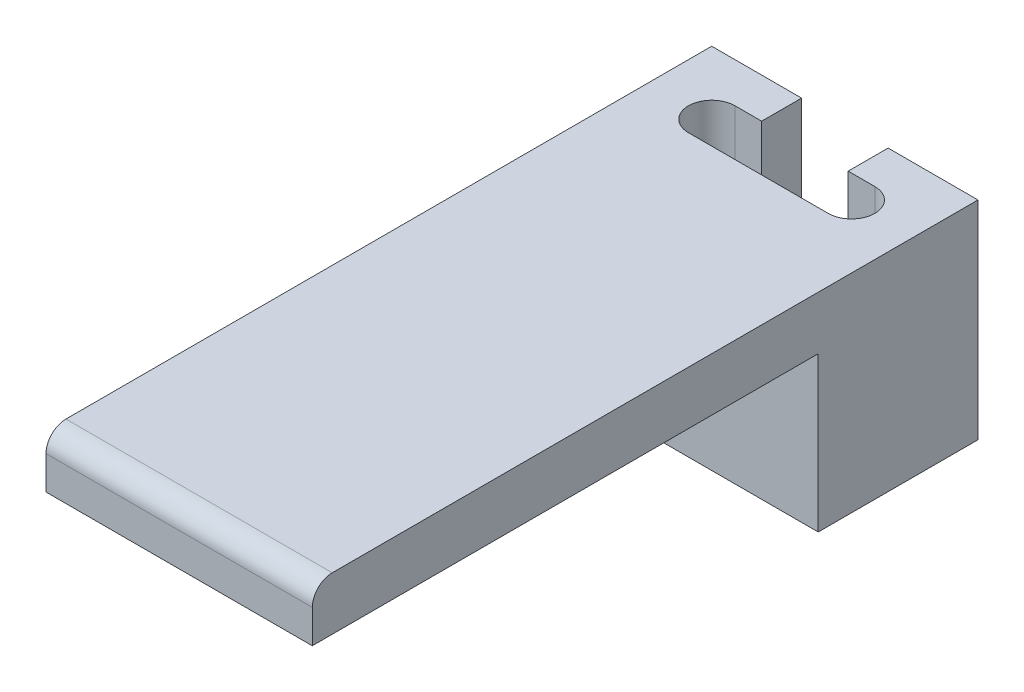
ISO-10303-21;
HEADER;
FILE_DESCRIPTION(('STEP AP214'),'2;1');
FILE_NAME('part.step','',(''),(''),'','','');
FILE_SCHEMA(('AUTOMOTIVE_DESIGN { 1 0 10303 214 1 1 1 1 }'));
ENDSEC;
DATA;
#1=APPLICATION_CONTEXT('core data for automotive mechanical design processes');
#2=APPLICATION_PROTOCOL_DEFINITION('international standard','automotive_design',2000,#1);
#3=PRODUCT_CONTEXT('',#1,'mechanical');
#4=PRODUCT('Part','Part','',(#3));
#5=PRODUCT_RELATED_PRODUCT_CATEGORY('part','',(#4));
#6=PRODUCT_DEFINITION_FORMATION('','',#4);
#7=PRODUCT_DEFINITION_CONTEXT('part definition',#1,'design');
#8=PRODUCT_DEFINITION('design','',#6,#7);
#9=PRODUCT_DEFINITION_SHAPE('','',#8);
#10=(LENGTH_UNIT() NAMED_UNIT(*) SI_UNIT(.MILLI.,.METRE.));
#11=(NAMED_UNIT(*) PLANE_ANGLE_UNIT() SI_UNIT($,.RADIAN.));
#12=(NAMED_UNIT(*) SI_UNIT($,.STERADIAN.) SOLID_ANGLE_UNIT());
#13=UNCERTAINTY_MEASURE_WITH_UNIT(LENGTH_MEASURE(1.E-05),#10,'distance_accuracy_value','');
#14=(GEOMETRIC_REPRESENTATION_CONTEXT(3) GLOBAL_UNCERTAINTY_ASSIGNED_CONTEXT((#13)) GLOBAL_UNIT_ASSIGNED_CONTEXT((#10,
#11,#12)) REPRESENTATION_CONTEXT('',''));
#15=CARTESIAN_POINT('',(0.,0.,0.));
#16=DIRECTION('',(0.,0.,1.));
#17=DIRECTION('',(1.,0.,0.));
#18=AXIS2_PLACEMENT_3D('',#15,#16,#17);
#19=CARTESIAN_POINT('',(0.,1.13686837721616E-13,50.));
#20=DIRECTION('',(0.,1.,0.));
#21=DIRECTION('',(0.,0.,1.));
#22=AXIS2_PLACEMENT_3D('',#19,#20,#21);
#23=PLANE('',#22);
#24=DIRECTION('',(0.,0.,-1.));
#25=VECTOR('',#24,1.);
#26=CARTESIAN_POINT('',(6.75,1.13686837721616E-13,50.));
#27=LINE('',#26,#25);
#28=CARTESIAN_POINT('',(6.75,1.11022302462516E-13,3.00000000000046));
#29=VERTEX_POINT('',#28);
#30=CARTESIAN_POINT('',(6.75,1.11022302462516E-13,0.));
#31=VERTEX_POINT('',#30);
#32=EDGE_CURVE('E184',#29,#31,#27,.T.);
#33=ORIENTED_EDGE('',*,*,#32,.F.);
#34=DIRECTION('',(1.,0.,2.27465615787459E-13));
#35=VECTOR('',#34,1.);
#36=CARTESIAN_POINT('',(1.06908839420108E-11,1.13686837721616E-13,2.99999999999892));
#37=LINE('',#36,#35);
#38=CARTESIAN_POINT('',(4.75,1.11022302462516E-13,3.));
#39=VERTEX_POINT('',#38);
#40=EDGE_CURVE('E194',#39,#29,#37,.T.);
#41=ORIENTED_EDGE('',*,*,#40,.F.);
#42=CARTESIAN_POINT('',(4.75,1.11022302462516E-13,4.75));
#43=DIRECTION('',(0.,1.,0.));
#44=DIRECTION('',(0.,0.,1.));
#45=AXIS2_PLACEMENT_3D('',#42,#43,#44);
#46=CIRCLE('',#45,1.75);
#47=CARTESIAN_POINT('',(4.75,1.11022302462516E-13,6.5));
#48=VERTEX_POINT('',#47);
#49=EDGE_CURVE('E192',#48,#39,#46,.F.);
#50=ORIENTED_EDGE('',*,*,#49,.F.);
#51=DIRECTION('',(-1.,0.,0.));
#52=VECTOR('',#51,1.);
#53=CARTESIAN_POINT('',(0.,1.13686837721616E-13,6.5));
#54=LINE('',#53,#52);
#55=CARTESIAN_POINT('',(15.25,1.11022302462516E-13,6.5));
#56=VERTEX_POINT('',#55);
#57=EDGE_CURVE('E190',#56,#48,#54,.T.);
#58=ORIENTED_EDGE('',*,*,#57,.F.);
#59=CARTESIAN_POINT('',(15.25,1.11022302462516E-13,4.75));
#60=DIRECTION('',(0.,1.,0.));
#61=DIRECTION('',(0.,0.,1.));
#62=AXIS2_PLACEMENT_3D('',#59,#60,#61);
#63=CIRCLE('',#62,1.75);
#64=CARTESIAN_POINT('',(15.25,1.11022302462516E-13,3.));
#65=VERTEX_POINT('',#64);
#66=EDGE_CURVE('E188',#65,#56,#63,.F.);
#67=ORIENTED_EDGE('',*,*,#66,.F.);
#68=DIRECTION('',(1.,0.,0.));
#69=VECTOR('',#68,1.);
#70=CARTESIAN_POINT('',(0.,1.13686837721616E-13,3.));
#71=LINE('',#70,#69);
#72=CARTESIAN_POINT('',(13.2500000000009,1.11022302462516E-13,3.));
#73=VERTEX_POINT('',#72);
#74=EDGE_CURVE('E186',#73,#65,#71,.T.);
#75=ORIENTED_EDGE('',*,*,#74,.F.);
#76=DIRECTION('',(3.03576608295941E-13,0.,1.));
#77=VECTOR('',#76,1.);
#78=CARTESIAN_POINT('',(13.2500000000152,1.13686837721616E-13,49.999999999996));
#79=LINE('',#78,#77);
#80=CARTESIAN_POINT('',(13.25,1.11022302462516E-13,0.));
#81=VERTEX_POINT('',#80);
#82=EDGE_CURVE('E141',#81,#73,#79,.T.);
#83=ORIENTED_EDGE('',*,*,#82,.F.);
#84=DIRECTION('',(1.,0.,0.));
#85=VECTOR('',#84,1.);
#86=CARTESIAN_POINT('',(0.,1.13686837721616E-13,0.));
#87=LINE('',#86,#85);
#88=CARTESIAN_POINT('',(20.,1.13686837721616E-13,0.));
#89=VERTEX_POINT('',#88);
#90=EDGE_CURVE('E215',#81,#89,#87,.T.);
#91=ORIENTED_EDGE('',*,*,#90,.T.);
#92=DIRECTION('',(0.,0.,-1.));
#93=VECTOR('',#92,1.);
#94=CARTESIAN_POINT('',(20.,1.13686837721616E-13,50.));
#95=LINE('',#94,#93);
#96=CARTESIAN_POINT('',(20.,0.,12.));
#97=VERTEX_POINT('',#96);
#98=EDGE_CURVE('E240',#97,#89,#95,.T.);
#99=ORIENTED_EDGE('',*,*,#98,.F.);
#100=DIRECTION('',(1.,0.,0.));
#101=VECTOR('',#100,1.);
#102=CARTESIAN_POINT('',(-30.,0.,12.));
#103=LINE('',#102,#101);
#104=CARTESIAN_POINT('',(0.,0.,12.));
#105=VERTEX_POINT('',#104);
#106=EDGE_CURVE('E210',#105,#97,#103,.T.);
#107=ORIENTED_EDGE('',*,*,#106,.F.);
#108=DIRECTION('',(0.,0.,-1.));
#109=VECTOR('',#108,1.);
#110=CARTESIAN_POINT('',(0.,1.13686837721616E-13,50.));
#111=LINE('',#110,#109);
#112=CARTESIAN_POINT('',(0.,1.13686837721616E-13,0.));
#113=VERTEX_POINT('',#112);
#114=EDGE_CURVE('E223',#105,#113,#111,.T.);
#115=ORIENTED_EDGE('',*,*,#114,.T.);
#116=EDGE_CURVE('E224',#113,#31,#87,.T.);
#117=ORIENTED_EDGE('',*,*,#116,.T.);
#118=EDGE_LOOP('',(#33,#41,#50,#58,#67,#75,#83,#91,#99,#107,#115,#117));
#119=FACE_BOUND('',#118,.T.);
#120=ADVANCED_FACE('F34',(#119),#23,.F.);
#121=CARTESIAN_POINT('',(0.,15.6000000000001,50.));
#122=DIRECTION('',(0.,-1.,0.));
#123=DIRECTION('',(0.,0.,-1.));
#124=AXIS2_PLACEMENT_3D('',#121,#122,#123);
#125=PLANE('',#124);
#126=DIRECTION('',(0.,0.,-1.));
#127=VECTOR('',#126,1.);
#128=CARTESIAN_POINT('',(6.75,15.6000000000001,3.00000000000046));
#129=LINE('',#128,#127);
#130=CARTESIAN_POINT('',(6.75,15.6000000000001,3.00000000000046));
#131=VERTEX_POINT('',#130);
#132=CARTESIAN_POINT('',(6.75,15.6000000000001,0.));
#133=VERTEX_POINT('',#132);
#134=EDGE_CURVE('E145',#131,#133,#129,.T.);
#135=ORIENTED_EDGE('',*,*,#134,.T.);
#136=DIRECTION('',(-1.,0.,0.));
#137=VECTOR('',#136,1.);
#138=CARTESIAN_POINT('',(0.,15.6000000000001,0.));
#139=LINE('',#138,#137);
#140=CARTESIAN_POINT('',(0.,15.6000000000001,0.));
#141=VERTEX_POINT('',#140);
#142=EDGE_CURVE('E230',#133,#141,#139,.T.);
#143=ORIENTED_EDGE('',*,*,#142,.T.);
#144=DIRECTION('',(0.,0.,-1.));
#145=VECTOR('',#144,1.);
#146=CARTESIAN_POINT('',(0.,15.6000000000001,50.));
#147=LINE('',#146,#145);
#148=CARTESIAN_POINT('',(0.,15.6,48.5));
#149=VERTEX_POINT('',#148);
#150=EDGE_CURVE('E235',#149,#141,#147,.T.);
#151=ORIENTED_EDGE('',*,*,#150,.F.);
#152=DIRECTION('',(1.,0.,0.));
#153=VECTOR('',#152,1.);
#154=CARTESIAN_POINT('',(-30.,15.6,48.5));
#155=LINE('',#154,#153);
#156=CARTESIAN_POINT('',(20.,15.6,48.5));
#157=VERTEX_POINT('',#156);
#158=EDGE_CURVE('E206',#149,#157,#155,.T.);
#159=ORIENTED_EDGE('',*,*,#158,.T.);
#160=DIRECTION('',(0.,0.,-1.));
#161=VECTOR('',#160,1.);
#162=CARTESIAN_POINT('',(20.,15.6000000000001,50.));
#163=LINE('',#162,#161);
#164=CARTESIAN_POINT('',(20.,15.6000000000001,0.));
#165=VERTEX_POINT('',#164);
#166=EDGE_CURVE('E238',#157,#165,#163,.T.);
#167=ORIENTED_EDGE('',*,*,#166,.T.);
#168=CARTESIAN_POINT('',(13.25,15.6000000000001,0.));
#169=VERTEX_POINT('',#168);
#170=EDGE_CURVE('E160',#165,#169,#139,.T.);
#171=ORIENTED_EDGE('',*,*,#170,.T.);
#172=DIRECTION('',(3.03576608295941E-13,0.,1.));
#173=VECTOR('',#172,1.);
#174=CARTESIAN_POINT('',(13.25,15.6000000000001,0.));
#175=LINE('',#174,#173);
#176=CARTESIAN_POINT('',(13.2500000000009,15.6000000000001,3.));
#177=VERTEX_POINT('',#176);
#178=EDGE_CURVE('E48',#169,#177,#175,.T.);
#179=ORIENTED_EDGE('',*,*,#178,.T.);
#180=DIRECTION('',(1.,0.,0.));
#181=VECTOR('',#180,1.);
#182=CARTESIAN_POINT('',(13.2500000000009,15.6000000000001,3.));
#183=LINE('',#182,#181);
#184=CARTESIAN_POINT('',(15.25,15.6000000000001,3.));
#185=VERTEX_POINT('',#184);
#186=EDGE_CURVE('E148',#177,#185,#183,.T.);
#187=ORIENTED_EDGE('',*,*,#186,.T.);
#188=CARTESIAN_POINT('',(15.25,15.6000000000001,4.75));
#189=DIRECTION('',(0.,-1.,0.));
#190=DIRECTION('',(0.,0.,1.));
#191=AXIS2_PLACEMENT_3D('',#188,#189,#190);
#192=CIRCLE('',#191,1.75);
#193=CARTESIAN_POINT('',(15.25,15.6000000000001,6.5));
#194=VERTEX_POINT('',#193);
#195=EDGE_CURVE('E154',#185,#194,#192,.T.);
#196=ORIENTED_EDGE('',*,*,#195,.T.);
#197=DIRECTION('',(-1.,0.,0.));
#198=VECTOR('',#197,1.);
#199=CARTESIAN_POINT('',(4.75,15.6000000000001,6.5));
#200=LINE('',#199,#198);
#201=CARTESIAN_POINT('',(4.75,15.6000000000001,6.5));
#202=VERTEX_POINT('',#201);
#203=EDGE_CURVE('E164',#194,#202,#200,.T.);
#204=ORIENTED_EDGE('',*,*,#203,.T.);
#205=CARTESIAN_POINT('',(4.75,15.6000000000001,4.75));
#206=DIRECTION('',(0.,-1.,0.));
#207=DIRECTION('',(0.,0.,1.));
#208=AXIS2_PLACEMENT_3D('',#205,#206,#207);
#209=CIRCLE('',#208,1.75);
#210=CARTESIAN_POINT('',(4.75,15.6000000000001,3.));
#211=VERTEX_POINT('',#210);
#212=EDGE_CURVE('E167',#202,#211,#209,.T.);
#213=ORIENTED_EDGE('',*,*,#212,.T.);
#214=DIRECTION('',(1.,0.,2.27465615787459E-13));
#215=VECTOR('',#214,1.);
#216=CARTESIAN_POINT('',(4.75,15.6000000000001,3.));
#217=LINE('',#216,#215);
#218=EDGE_CURVE('E170',#211,#131,#217,.T.);
#219=ORIENTED_EDGE('',*,*,#218,.T.);
#220=EDGE_LOOP('',(#135,#143,#151,#159,#167,#171,#179,#187,#196,#204,#213,#219));
#221=FACE_BOUND('',#220,.T.);
#222=ADVANCED_FACE('F158',(#221),#125,.F.);
#223=CARTESIAN_POINT('',(20.,1.13686837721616E-13,0.));
#224=DIRECTION('',(0.,0.,1.));
#225=DIRECTION('',(1.,0.,0.));
#226=AXIS2_PLACEMENT_3D('',#223,#224,#225);
#227=PLANE('',#226);
#228=DIRECTION('',(0.,1.,0.));
#229=VECTOR('',#228,1.);
#230=CARTESIAN_POINT('',(6.75,1.13686837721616E-13,0.));
#231=LINE('',#230,#229);
#232=EDGE_CURVE('E12',#31,#133,#231,.T.);
#233=ORIENTED_EDGE('',*,*,#232,.F.);
#234=ORIENTED_EDGE('',*,*,#116,.F.);
#235=DIRECTION('',(0.,-1.,0.));
#236=VECTOR('',#235,1.);
#237=CARTESIAN_POINT('',(0.,1.13686837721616E-13,0.));
#238=LINE('',#237,#236);
#239=EDGE_CURVE('E220',#141,#113,#238,.T.);
#240=ORIENTED_EDGE('',*,*,#239,.F.);
#241=ORIENTED_EDGE('',*,*,#142,.F.);
#242=EDGE_LOOP('',(#233,#234,#240,#241));
#243=FACE_BOUND('',#242,.T.);
#244=ADVANCED_FACE('F274',(#243),#227,.F.);
#245=DIRECTION('',(0.,-1.,0.));
#246=VECTOR('',#245,1.);
#247=CARTESIAN_POINT('',(13.25,1.13686837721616E-13,0.));
#248=LINE('',#247,#246);
#249=EDGE_CURVE('E41',#169,#81,#248,.T.);
#250=ORIENTED_EDGE('',*,*,#249,.F.);
#251=ORIENTED_EDGE('',*,*,#170,.F.);
#252=DIRECTION('',(0.,1.,0.));
#253=VECTOR('',#252,1.);
#254=CARTESIAN_POINT('',(20.,1.13686837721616E-13,0.));
#255=LINE('',#254,#253);
#256=EDGE_CURVE('E227',#89,#165,#255,.T.);
#257=ORIENTED_EDGE('',*,*,#256,.F.);
#258=ORIENTED_EDGE('',*,*,#90,.F.);
#259=EDGE_LOOP('',(#250,#251,#257,#258));
#260=FACE_BOUND('',#259,.T.);
#261=ADVANCED_FACE('F256',(#260),#227,.F.);
#262=CARTESIAN_POINT('',(20.,1.13686837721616E-13,50.));
#263=DIRECTION('',(-1.,0.,0.));
#264=DIRECTION('',(0.,0.,1.));
#265=AXIS2_PLACEMENT_3D('',#262,#263,#264);
#266=PLANE('',#265);
#267=CARTESIAN_POINT('',(20.,14.1,48.5));
#268=DIRECTION('',(1.,0.,0.));
#269=DIRECTION('',(0.,0.,-1.));
#270=AXIS2_PLACEMENT_3D('',#267,#268,#269);
#271=CIRCLE('',#270,1.5);
#272=CARTESIAN_POINT('',(20.,14.1,50.));
#273=VERTEX_POINT('',#272);
#274=EDGE_CURVE('E196',#157,#273,#271,.T.);
#275=ORIENTED_EDGE('',*,*,#274,.T.);
#276=DIRECTION('',(0.,1.,0.));
#277=VECTOR('',#276,1.);
#278=CARTESIAN_POINT('',(20.,1.13686837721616E-13,50.));
#279=LINE('',#278,#277);
#280=CARTESIAN_POINT('',(20.,11.6,50.));
#281=VERTEX_POINT('',#280);
#282=EDGE_CURVE('E216',#281,#273,#279,.T.);
#283=ORIENTED_EDGE('',*,*,#282,.F.);
#284=DIRECTION('',(0.,0.,-1.));
#285=VECTOR('',#284,1.);
#286=CARTESIAN_POINT('',(20.,11.6,50.));
#287=LINE('',#286,#285);
#288=CARTESIAN_POINT('',(20.,11.6,12.));
#289=VERTEX_POINT('',#288);
#290=EDGE_CURVE('E199',#281,#289,#287,.T.);
#291=ORIENTED_EDGE('',*,*,#290,.T.);
#292=DIRECTION('',(0.,-1.,0.));
#293=VECTOR('',#292,1.);
#294=CARTESIAN_POINT('',(20.,0.,12.));
#295=LINE('',#294,#293);
#296=EDGE_CURVE('E202',#289,#97,#295,.T.);
#297=ORIENTED_EDGE('',*,*,#296,.T.);
#298=ORIENTED_EDGE('',*,*,#98,.T.);
#299=ORIENTED_EDGE('',*,*,#256,.T.);
#300=ORIENTED_EDGE('',*,*,#166,.F.);
#301=EDGE_LOOP('',(#275,#283,#291,#297,#298,#299,#300));
#302=FACE_BOUND('',#301,.T.);
#303=ADVANCED_FACE('F259',(#302),#266,.F.);
#304=CARTESIAN_POINT('',(0.,1.13686837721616E-13,50.));
#305=DIRECTION('',(1.,0.,0.));
#306=DIRECTION('',(0.,0.,-1.));
#307=AXIS2_PLACEMENT_3D('',#304,#305,#306);
#308=PLANE('',#307);
#309=CARTESIAN_POINT('',(0.,14.1,48.5));
#310=DIRECTION('',(1.,0.,0.));
#311=DIRECTION('',(0.,0.,-1.));
#312=AXIS2_PLACEMENT_3D('',#309,#310,#311);
#313=CIRCLE('',#312,1.5);
#314=CARTESIAN_POINT('',(0.,14.1,50.));
#315=VERTEX_POINT('',#314);
#316=EDGE_CURVE('E56',#149,#315,#313,.T.);
#317=ORIENTED_EDGE('',*,*,#316,.F.);
#318=ORIENTED_EDGE('',*,*,#150,.T.);
#319=ORIENTED_EDGE('',*,*,#239,.T.);
#320=ORIENTED_EDGE('',*,*,#114,.F.);
#321=DIRECTION('',(0.,-1.,0.));
#322=VECTOR('',#321,1.);
#323=CARTESIAN_POINT('',(0.,1.13686837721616E-13,12.));
#324=LINE('',#323,#322);
#325=CARTESIAN_POINT('',(0.,11.6,12.));
#326=VERTEX_POINT('',#325);
#327=EDGE_CURVE('E248',#326,#105,#324,.T.);
#328=ORIENTED_EDGE('',*,*,#327,.F.);
#329=DIRECTION('',(0.,0.,-1.));
#330=VECTOR('',#329,1.);
#331=CARTESIAN_POINT('',(0.,11.6,50.));
#332=LINE('',#331,#330);
#333=CARTESIAN_POINT('',(0.,11.6,50.));
#334=VERTEX_POINT('',#333);
#335=EDGE_CURVE('E209',#334,#326,#332,.T.);
#336=ORIENTED_EDGE('',*,*,#335,.F.);
#337=DIRECTION('',(0.,-1.,0.));
#338=VECTOR('',#337,1.);
#339=CARTESIAN_POINT('',(0.,1.13686837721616E-13,50.));
#340=LINE('',#339,#338);
#341=EDGE_CURVE('E219',#315,#334,#340,.T.);
#342=ORIENTED_EDGE('',*,*,#341,.F.);
#343=EDGE_LOOP('',(#317,#318,#319,#320,#328,#336,#342));
#344=FACE_BOUND('',#343,.T.);
#345=ADVANCED_FACE('F266',(#344),#308,.F.);
#346=CARTESIAN_POINT('',(20.,1.13686837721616E-13,50.));
#347=DIRECTION('',(0.,0.,1.));
#348=DIRECTION('',(1.,0.,0.));
#349=AXIS2_PLACEMENT_3D('',#346,#347,#348);
#350=PLANE('',#349);
#351=DIRECTION('',(1.,0.,0.));
#352=VECTOR('',#351,1.);
#353=CARTESIAN_POINT('',(-30.,14.1,50.));
#354=LINE('',#353,#352);
#355=EDGE_CURVE('E246',#315,#273,#354,.T.);
#356=ORIENTED_EDGE('',*,*,#355,.F.);
#357=ORIENTED_EDGE('',*,*,#341,.T.);
#358=DIRECTION('',(1.,0.,0.));
#359=VECTOR('',#358,1.);
#360=CARTESIAN_POINT('',(20.,11.6,50.));
#361=LINE('',#360,#359);
#362=EDGE_CURVE('E243',#334,#281,#361,.T.);
#363=ORIENTED_EDGE('',*,*,#362,.T.);
#364=ORIENTED_EDGE('',*,*,#282,.T.);
#365=EDGE_LOOP('',(#356,#357,#363,#364));
#366=FACE_BOUND('',#365,.T.);
#367=ADVANCED_FACE('F299',(#366),#350,.T.);
#368=CARTESIAN_POINT('',(-30.,11.6,50.));
#369=DIRECTION('',(0.,-1.,0.));
#370=DIRECTION('',(0.,0.,-1.));
#371=AXIS2_PLACEMENT_3D('',#368,#369,#370);
#372=PLANE('',#371);
#373=ORIENTED_EDGE('',*,*,#335,.T.);
#374=DIRECTION('',(1.,0.,0.));
#375=VECTOR('',#374,1.);
#376=CARTESIAN_POINT('',(-30.,11.6,12.));
#377=LINE('',#376,#375);
#378=EDGE_CURVE('E205',#326,#289,#377,.T.);
#379=ORIENTED_EDGE('',*,*,#378,.T.);
#380=ORIENTED_EDGE('',*,*,#290,.F.);
#381=ORIENTED_EDGE('',*,*,#362,.F.);
#382=EDGE_LOOP('',(#373,#379,#380,#381));
#383=FACE_BOUND('',#382,.T.);
#384=ADVANCED_FACE('F302',(#383),#372,.T.);
#385=CARTESIAN_POINT('',(-30.,0.,12.));
#386=DIRECTION('',(0.,0.,1.));
#387=DIRECTION('',(1.,0.,0.));
#388=AXIS2_PLACEMENT_3D('',#385,#386,#387);
#389=PLANE('',#388);
#390=ORIENTED_EDGE('',*,*,#327,.T.);
#391=ORIENTED_EDGE('',*,*,#106,.T.);
#392=ORIENTED_EDGE('',*,*,#296,.F.);
#393=ORIENTED_EDGE('',*,*,#378,.F.);
#394=EDGE_LOOP('',(#390,#391,#392,#393));
#395=FACE_BOUND('',#394,.T.);
#396=ADVANCED_FACE('F304',(#395),#389,.T.);
#397=CARTESIAN_POINT('',(-30.,14.1,48.5));
#398=DIRECTION('',(1.,0.,0.));
#399=DIRECTION('',(0.,0.,-1.));
#400=AXIS2_PLACEMENT_3D('',#397,#398,#399);
#401=CYLINDRICAL_SURFACE('',#400,1.5);
#402=ORIENTED_EDGE('',*,*,#316,.T.);
#403=ORIENTED_EDGE('',*,*,#355,.T.);
#404=ORIENTED_EDGE('',*,*,#274,.F.);
#405=ORIENTED_EDGE('',*,*,#158,.F.);
#406=EDGE_LOOP('',(#402,#403,#404,#405));
#407=FACE_BOUND('',#406,.T.);
#408=ADVANCED_FACE('F296',(#407),#401,.T.);
#409=CARTESIAN_POINT('',(4.75,-34.3999999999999,3.));
#410=DIRECTION('',(-2.27465615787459E-13,0.,1.));
#411=DIRECTION('',(1.,0.,2.27465615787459E-13));
#412=AXIS2_PLACEMENT_3D('',#409,#410,#411);
#413=PLANE('',#412);
#414=ORIENTED_EDGE('',*,*,#40,.T.);
#415=DIRECTION('',(0.,1.,0.));
#416=VECTOR('',#415,1.);
#417=CARTESIAN_POINT('',(6.75,-34.3999999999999,3.00000000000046));
#418=LINE('',#417,#416);
#419=EDGE_CURVE('E174',#29,#131,#418,.T.);
#420=ORIENTED_EDGE('',*,*,#419,.T.);
#421=ORIENTED_EDGE('',*,*,#218,.F.);
#422=DIRECTION('',(0.,1.,0.));
#423=VECTOR('',#422,1.);
#424=CARTESIAN_POINT('',(4.75,-34.3999999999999,3.));
#425=LINE('',#424,#423);
#426=EDGE_CURVE('E176',#39,#211,#425,.T.);
#427=ORIENTED_EDGE('',*,*,#426,.F.);
#428=EDGE_LOOP('',(#414,#420,#421,#427));
#429=FACE_BOUND('',#428,.T.);
#430=ADVANCED_FACE('F283',(#429),#413,.T.);
#431=CARTESIAN_POINT('',(4.75,-34.3999999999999,4.75));
#432=DIRECTION('',(0.,1.,0.));
#433=DIRECTION('',(0.,0.,1.));
#434=AXIS2_PLACEMENT_3D('',#431,#432,#433);
#435=CYLINDRICAL_SURFACE('',#434,1.75);
#436=ORIENTED_EDGE('',*,*,#49,.T.);
#437=ORIENTED_EDGE('',*,*,#426,.T.);
#438=ORIENTED_EDGE('',*,*,#212,.F.);
#439=DIRECTION('',(0.,1.,0.));
#440=VECTOR('',#439,1.);
#441=CARTESIAN_POINT('',(4.75,-34.3999999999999,6.5));
#442=LINE('',#441,#440);
#443=EDGE_CURVE('E178',#48,#202,#442,.T.);
#444=ORIENTED_EDGE('',*,*,#443,.F.);
#445=EDGE_LOOP('',(#436,#437,#438,#444));
#446=FACE_BOUND('',#445,.T.);
#447=ADVANCED_FACE('F287',(#446),#435,.F.);
#448=CARTESIAN_POINT('',(4.75,-34.3999999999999,6.5));
#449=DIRECTION('',(0.,0.,-1.));
#450=DIRECTION('',(-1.,0.,0.));
#451=AXIS2_PLACEMENT_3D('',#448,#449,#450);
#452=PLANE('',#451);
#453=ORIENTED_EDGE('',*,*,#57,.T.);
#454=ORIENTED_EDGE('',*,*,#443,.T.);
#455=ORIENTED_EDGE('',*,*,#203,.F.);
#456=DIRECTION('',(0.,1.,0.));
#457=VECTOR('',#456,1.);
#458=CARTESIAN_POINT('',(15.25,-34.3999999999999,6.5));
#459=LINE('',#458,#457);
#460=EDGE_CURVE('E180',#56,#194,#459,.T.);
#461=ORIENTED_EDGE('',*,*,#460,.F.);
#462=EDGE_LOOP('',(#453,#454,#455,#461));
#463=FACE_BOUND('',#462,.T.);
#464=ADVANCED_FACE('F292',(#463),#452,.T.);
#465=CARTESIAN_POINT('',(15.25,-34.3999999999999,4.75));
#466=DIRECTION('',(0.,1.,0.));
#467=DIRECTION('',(0.,0.,1.));
#468=AXIS2_PLACEMENT_3D('',#465,#466,#467);
#469=CYLINDRICAL_SURFACE('',#468,1.75);
#470=ORIENTED_EDGE('',*,*,#66,.T.);
#471=ORIENTED_EDGE('',*,*,#460,.T.);
#472=ORIENTED_EDGE('',*,*,#195,.F.);
#473=DIRECTION('',(0.,1.,0.));
#474=VECTOR('',#473,1.);
#475=CARTESIAN_POINT('',(15.25,-34.3999999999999,3.));
#476=LINE('',#475,#474);
#477=EDGE_CURVE('E144',#65,#185,#476,.T.);
#478=ORIENTED_EDGE('',*,*,#477,.F.);
#479=EDGE_LOOP('',(#470,#471,#472,#478));
#480=FACE_BOUND('',#479,.T.);
#481=ADVANCED_FACE('F295',(#480),#469,.F.);
#482=CARTESIAN_POINT('',(13.2500000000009,-34.3999999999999,3.));
#483=DIRECTION('',(0.,0.,1.));
#484=DIRECTION('',(1.,0.,0.));
#485=AXIS2_PLACEMENT_3D('',#482,#483,#484);
#486=PLANE('',#485);
#487=ORIENTED_EDGE('',*,*,#74,.T.);
#488=ORIENTED_EDGE('',*,*,#477,.T.);
#489=ORIENTED_EDGE('',*,*,#186,.F.);
#490=DIRECTION('',(0.,1.,0.));
#491=VECTOR('',#490,1.);
#492=CARTESIAN_POINT('',(13.2500000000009,-34.3999999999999,3.));
#493=LINE('',#492,#491);
#494=EDGE_CURVE('E137',#73,#177,#493,.T.);
#495=ORIENTED_EDGE('',*,*,#494,.F.);
#496=EDGE_LOOP('',(#487,#488,#489,#495));
#497=FACE_BOUND('',#496,.T.);
#498=ADVANCED_FACE('F149',(#497),#486,.T.);
#499=CARTESIAN_POINT('',(6.75,-34.3999999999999,3.00000000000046));
#500=DIRECTION('',(1.,0.,0.));
#501=DIRECTION('',(0.,0.,-1.));
#502=AXIS2_PLACEMENT_3D('',#499,#500,#501);
#503=PLANE('',#502);
#504=ORIENTED_EDGE('',*,*,#32,.T.);
#505=ORIENTED_EDGE('',*,*,#232,.T.);
#506=ORIENTED_EDGE('',*,*,#134,.F.);
#507=ORIENTED_EDGE('',*,*,#419,.F.);
#508=EDGE_LOOP('',(#504,#505,#506,#507));
#509=FACE_BOUND('',#508,.T.);
#510=ADVANCED_FACE('F279',(#509),#503,.T.);
#511=CARTESIAN_POINT('',(13.25,-34.3999999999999,0.));
#512=DIRECTION('',(-1.,0.,3.03576608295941E-13));
#513=DIRECTION('',(3.03576608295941E-13,0.,1.));
#514=AXIS2_PLACEMENT_3D('',#511,#512,#513);
#515=PLANE('',#514);
#516=ORIENTED_EDGE('',*,*,#82,.T.);
#517=ORIENTED_EDGE('',*,*,#494,.T.);
#518=ORIENTED_EDGE('',*,*,#178,.F.);
#519=ORIENTED_EDGE('',*,*,#249,.T.);
#520=EDGE_LOOP('',(#516,#517,#518,#519));
#521=FACE_BOUND('',#520,.T.);
#522=ADVANCED_FACE('F139',(#521),#515,.T.);
#523=CLOSED_SHELL('',(#120,#222,#244,#261,#303,#345,#367,#384,#396,#408,#430,#447,#464,#481,
#498,#510,#522));
#524=MANIFOLD_SOLID_BREP('B2',#523);
#525=ADVANCED_BREP_SHAPE_REPRESENTATION('',(#18,#524),#14);
#526=SHAPE_DEFINITION_REPRESENTATION(#9,#525);
ENDSEC;
END-ISO-10303-21;
